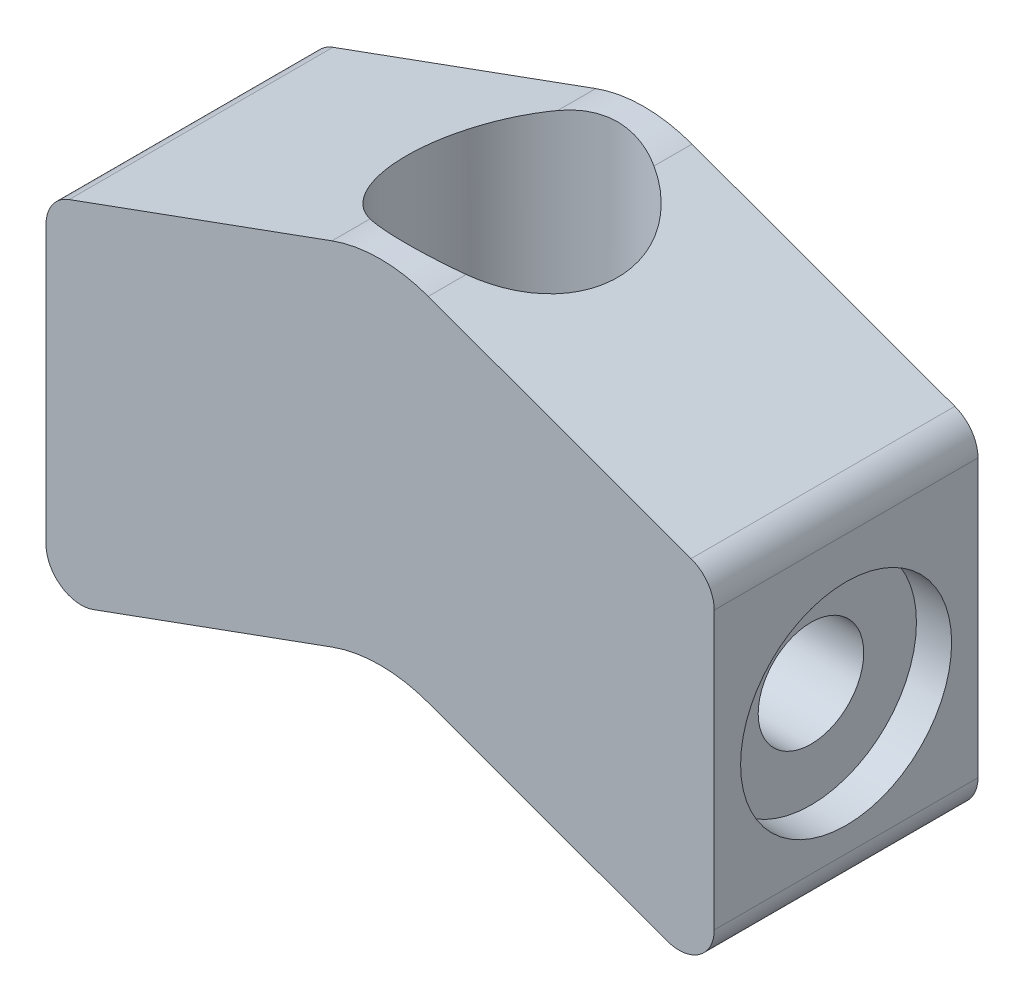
ISO-10303-21;
HEADER;
FILE_DESCRIPTION(('STEP AP214'),'2;1');
FILE_NAME('part.step','',(''),(''),'','','');
FILE_SCHEMA(('AUTOMOTIVE_DESIGN { 1 0 10303 214 1 1 1 1 }'));
ENDSEC;
DATA;
#1=APPLICATION_CONTEXT('core data for automotive mechanical design processes');
#2=APPLICATION_PROTOCOL_DEFINITION('international standard','automotive_design',2000,#1);
#3=PRODUCT_CONTEXT('',#1,'mechanical');
#4=PRODUCT('Part','Part','',(#3));
#5=PRODUCT_RELATED_PRODUCT_CATEGORY('part','',(#4));
#6=PRODUCT_DEFINITION_FORMATION('','',#4);
#7=PRODUCT_DEFINITION_CONTEXT('part definition',#1,'design');
#8=PRODUCT_DEFINITION('design','',#6,#7);
#9=PRODUCT_DEFINITION_SHAPE('','',#8);
#10=(LENGTH_UNIT() NAMED_UNIT(*) SI_UNIT(.MILLI.,.METRE.));
#11=(NAMED_UNIT(*) PLANE_ANGLE_UNIT() SI_UNIT($,.RADIAN.));
#12=(NAMED_UNIT(*) SI_UNIT($,.STERADIAN.) SOLID_ANGLE_UNIT());
#13=UNCERTAINTY_MEASURE_WITH_UNIT(LENGTH_MEASURE(1.E-05),#10,'distance_accuracy_value','');
#14=(GEOMETRIC_REPRESENTATION_CONTEXT(3) GLOBAL_UNCERTAINTY_ASSIGNED_CONTEXT((#13)) GLOBAL_UNIT_ASSIGNED_CONTEXT((#10,
#11,#12)) REPRESENTATION_CONTEXT('',''));
#15=CARTESIAN_POINT('',(0.,0.,0.));
#16=DIRECTION('',(0.,0.,1.));
#17=DIRECTION('',(1.,0.,0.));
#18=AXIS2_PLACEMENT_3D('',#15,#16,#17);
#19=CARTESIAN_POINT('',(19.,-18.4406551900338,0.));
#20=DIRECTION('',(-1.,0.,0.));
#21=DIRECTION('',(0.,-1.,0.));
#22=AXIS2_PLACEMENT_3D('',#19,#20,#21);
#23=CYLINDRICAL_SURFACE('',#22,3.);
#24=CARTESIAN_POINT('',(6.,-21.4406551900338,0.));
#25=CARTESIAN_POINT('',(5.99999934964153,-21.4406543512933,-0.07889414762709));
#26=CARTESIAN_POINT('',(5.99843869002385,-21.4375372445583,-0.15779662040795));
#27=CARTESIAN_POINT('',(5.99224358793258,-21.4251159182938,-0.315001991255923));
#28=CARTESIAN_POINT('',(5.98760776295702,-21.4158089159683,-0.393304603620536));
#29=CARTESIAN_POINT('',(5.96921978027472,-21.3786973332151,-0.626628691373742));
#30=CARTESIAN_POINT('',(5.95098734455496,-21.3417023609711,-0.779952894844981));
#31=CARTESIAN_POINT('',(5.90448966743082,-21.2450734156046,-1.07683586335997));
#32=CARTESIAN_POINT('',(5.87626344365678,-21.1855274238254,-1.22043005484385));
#33=CARTESIAN_POINT('',(5.81237302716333,-21.0459439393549,-1.49540820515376));
#34=CARTESIAN_POINT('',(5.77670942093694,-20.9659080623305,-1.62679312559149));
#35=CARTESIAN_POINT('',(5.69868752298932,-20.7821012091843,-1.88252701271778));
#36=CARTESIAN_POINT('',(5.65605474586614,-20.6771872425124,-2.0059694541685));
#37=CARTESIAN_POINT('',(5.56980033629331,-20.4490992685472,-2.23433451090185));
#38=CARTESIAN_POINT('',(5.5261779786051,-20.3259114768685,-2.33924301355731));
#39=CARTESIAN_POINT('',(5.43896347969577,-20.053170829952,-2.53576864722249));
#40=CARTESIAN_POINT('',(5.39563602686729,-19.9023142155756,-2.62572411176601));
#41=CARTESIAN_POINT('',(5.33782449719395,-19.6647043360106,-2.7403403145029));
#42=CARTESIAN_POINT('',(5.31974570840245,-19.583584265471,-2.77516786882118));
#43=CARTESIAN_POINT('',(5.28665768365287,-19.4180546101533,-2.83769299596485));
#44=CARTESIAN_POINT('',(5.27164663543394,-19.3336470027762,-2.86539478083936));
#45=CARTESIAN_POINT('',(5.24610341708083,-19.1672593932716,-2.91188280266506));
#46=CARTESIAN_POINT('',(5.23535838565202,-19.0854323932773,-2.93110042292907));
#47=CARTESIAN_POINT('',(5.21757784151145,-18.9201002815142,-2.9626355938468));
#48=CARTESIAN_POINT('',(5.21054036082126,-18.8365960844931,-2.97495680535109));
#49=CARTESIAN_POINT('',(5.20047756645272,-18.6686488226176,-2.99251382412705));
#50=CARTESIAN_POINT('',(5.19744983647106,-18.5842063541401,-2.99775389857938));
#51=CARTESIAN_POINT('',(5.19552555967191,-18.4151615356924,-3.00108452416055));
#52=CARTESIAN_POINT('',(5.19662861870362,-18.3305592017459,-2.9991757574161));
#53=CARTESIAN_POINT('',(5.20534668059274,-18.0979012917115,-2.98404973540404));
#54=CARTESIAN_POINT('',(5.21726794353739,-17.9504110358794,-2.96335042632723));
#55=CARTESIAN_POINT('',(5.25228182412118,-17.6614615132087,-2.90082280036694));
#56=CARTESIAN_POINT('',(5.2753780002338,-17.5200041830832,-2.85898775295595));
#57=CARTESIAN_POINT('',(5.33062568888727,-17.242975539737,-2.75462843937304));
#58=CARTESIAN_POINT('',(5.36297559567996,-17.1076180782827,-2.69164495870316));
#59=CARTESIAN_POINT('',(5.43310175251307,-16.8487502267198,-2.54712530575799));
#60=CARTESIAN_POINT('',(5.47088043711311,-16.7252451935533,-2.46558080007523));
#61=CARTESIAN_POINT('',(5.55339485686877,-16.477092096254,-2.27419808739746));
#62=CARTESIAN_POINT('',(5.59840533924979,-16.3542847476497,-2.16208335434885));
#63=CARTESIAN_POINT('',(5.6864286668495,-16.1284487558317,-1.91866675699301));
#64=CARTESIAN_POINT('',(5.72944054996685,-16.0254295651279,-1.78735577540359));
#65=CARTESIAN_POINT('',(5.81105962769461,-15.8375982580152,-1.50154951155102));
#66=CARTESIAN_POINT('',(5.84936952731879,-15.7538537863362,-1.3462607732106));
#67=CARTESIAN_POINT('',(5.91473643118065,-15.614364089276,-1.02139864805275));
#68=CARTESIAN_POINT('',(5.94180236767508,-15.5585966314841,-0.851836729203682));
#69=CARTESIAN_POINT('',(5.97973001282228,-15.4812289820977,-0.518299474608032));
#70=CARTESIAN_POINT('',(5.99174814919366,-15.4571814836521,-0.355024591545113));
#71=CARTESIAN_POINT('',(6.00219040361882,-15.4362609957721,-0.0263387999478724));
#72=CARTESIAN_POINT('',(6.00062096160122,-15.4393751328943,0.139071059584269));
#73=CARTESIAN_POINT('',(5.98473576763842,-15.471275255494,0.453698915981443));
#74=CARTESIAN_POINT('',(5.97141737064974,-15.4980527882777,0.603178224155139));
#75=CARTESIAN_POINT('',(5.93466513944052,-15.5733694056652,0.895220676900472));
#76=CARTESIAN_POINT('',(5.91123019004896,-15.6219108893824,1.03778305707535));
#77=CARTESIAN_POINT('',(5.85552754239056,-15.7406505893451,1.31666582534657));
#78=CARTESIAN_POINT('',(5.82302645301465,-15.8114283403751,1.45269119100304));
#79=CARTESIAN_POINT('',(5.75231922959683,-15.9719777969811,1.71138408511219));
#80=CARTESIAN_POINT('',(5.71411066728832,-16.0617575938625,1.83404588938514));
#81=CARTESIAN_POINT('',(5.63124663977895,-16.2679364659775,2.07530306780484));
#82=CARTESIAN_POINT('',(5.58632654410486,-16.3860837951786,2.19231623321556));
#83=CARTESIAN_POINT('',(5.49787174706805,-16.6404306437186,2.40556896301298));
#84=CARTESIAN_POINT('',(5.4543380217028,-16.7766425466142,2.50179415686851));
#85=CARTESIAN_POINT('',(5.3715357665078,-17.0715861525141,2.675123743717));
#86=CARTESIAN_POINT('',(5.33257588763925,-17.2310889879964,2.75107648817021));
#87=CARTESIAN_POINT('',(5.26722216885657,-17.5631853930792,2.87424847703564));
#88=CARTESIAN_POINT('',(5.24081214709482,-17.735761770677,2.92150474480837));
#89=CARTESIAN_POINT('',(5.2068450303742,-18.0713858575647,2.98158506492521));
#90=CARTESIAN_POINT('',(5.19772150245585,-18.2337579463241,2.997278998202));
#91=CARTESIAN_POINT('',(5.19496064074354,-18.5589963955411,3.00206745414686));
#92=CARTESIAN_POINT('',(5.20131659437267,-18.7218625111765,2.99117350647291));
#93=CARTESIAN_POINT('',(5.22713585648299,-19.0271056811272,2.94577840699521));
#94=CARTESIAN_POINT('',(5.24529281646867,-19.1699565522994,2.91362505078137));
#95=CARTESIAN_POINT('',(5.29113050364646,-19.448079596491,2.82952596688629));
#96=CARTESIAN_POINT('',(5.3188142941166,-19.5833493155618,2.77757387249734));
#97=CARTESIAN_POINT('',(5.38285583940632,-19.8525295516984,2.65144766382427));
#98=CARTESIAN_POINT('',(5.41967139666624,-19.9857381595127,2.57601505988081));
#99=CARTESIAN_POINT('',(5.49706022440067,-20.2384795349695,2.40645126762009));
#100=CARTESIAN_POINT('',(5.53763544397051,-20.3580051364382,2.31231035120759));
#101=CARTESIAN_POINT('',(5.62386853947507,-20.5950780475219,2.094616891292));
#102=CARTESIAN_POINT('',(5.66954494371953,-20.7106203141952,1.96888052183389));
#103=CARTESIAN_POINT('',(5.75633712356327,-20.9194563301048,1.69843715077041));
#104=CARTESIAN_POINT('',(5.79745043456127,-21.012738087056,1.55371998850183));
#105=CARTESIAN_POINT('',(5.85251406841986,-21.1338333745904,1.32452333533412));
#106=CARTESIAN_POINT('',(5.86982524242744,-21.1711753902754,1.24575314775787));
#107=CARTESIAN_POINT('',(5.90168845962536,-21.2390168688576,1.08479725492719));
#108=CARTESIAN_POINT('',(5.91624185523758,-21.2695196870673,1.00261324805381));
#109=CARTESIAN_POINT('',(5.94212690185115,-21.3232624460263,0.835616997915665));
#110=CARTESIAN_POINT('',(5.95346557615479,-21.3465182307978,0.750810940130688));
#111=CARTESIAN_POINT('',(5.97260771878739,-21.3855377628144,0.579142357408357));
#112=CARTESIAN_POINT('',(5.98041334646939,-21.4013060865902,0.492281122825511));
#113=CARTESIAN_POINT('',(5.99085829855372,-21.4223398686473,0.337824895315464));
#114=CARTESIAN_POINT('',(5.99428035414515,-21.4292021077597,0.270495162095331));
#115=CARTESIAN_POINT('',(5.99885151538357,-21.4383601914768,0.135445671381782));
#116=CARTESIAN_POINT('',(6.00000055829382,-21.4406559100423,0.0677259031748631));
#117=CARTESIAN_POINT('',(6.,-21.4406551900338,0.));
#118=B_SPLINE_CURVE_WITH_KNOTS('',3,(#24,#25,#26,#27,#28,#29,#30,#31,#32,#33,#34,#35,#36,#37,
#38,#39,#40,#41,#42,#43,#44,#45,#46,#47,#48,#49,#50,#51,#52,#53,#54,#55,#56,#57,#58,#59,#60,#61,
#62,#63,#64,#65,#66,#67,#68,#69,#70,#71,#72,#73,#74,#75,#76,#77,#78,#79,#80,#81,#82,#83,#84,#85,
#86,#87,#88,#89,#90,#91,#92,#93,#94,#95,#96,#97,#98,#99,#100,#101,#102,#103,#104,#105,#106,#107,
#108,#109,#110,#111,#112,#113,#114,#115,#116,#117),.UNSPECIFIED.,.T.,.F.,(4,2,2,2,2,2,2,2,2,2,2,
2,2,2,2,2,2,2,2,2,2,2,2,2,2,2,2,2,2,2,2,2,2,2,2,2,2,2,2,2,2,2,2,2,2,2,4),(0.,0.236611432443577,
0.473329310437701,0.947100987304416,1.41904300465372,1.89094781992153,2.39140181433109,
2.89223525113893,3.4319083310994,3.70192714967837,3.97178599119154,4.2256372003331,
4.47935352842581,4.73291689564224,4.98645606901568,5.43238672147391,5.87845946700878,
6.33492255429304,6.79159098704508,7.30616358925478,7.82098138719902,8.35970601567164,
8.89800185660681,9.3917140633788,9.88519228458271,10.3404225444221,10.7957029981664,
11.2640010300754,11.7324988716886,12.2470036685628,12.7618630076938,13.3016558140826,
13.8407507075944,14.3280945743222,14.8152271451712,15.2559532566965,15.6968212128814,
16.1673090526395,16.6380421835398,17.1659726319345,17.6941868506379,17.9605054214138,
18.2266930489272,18.4922945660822,18.7577335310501,18.9608446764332,19.1639614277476),.UNSPECIFIED.);
#119=CARTESIAN_POINT('',(6.,-21.4406551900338,0.));
#120=VERTEX_POINT('',#119);
#121=EDGE_CURVE('E216',#120,#120,#118,.T.);
#122=ORIENTED_EDGE('',*,*,#121,.F.);
#123=EDGE_LOOP('',(#122));
#124=FACE_BOUND('',#123,.T.);
#125=CARTESIAN_POINT('',(17.,-18.4406551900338,0.));
#126=DIRECTION('',(1.,0.,0.));
#127=DIRECTION('',(0.,1.,0.));
#128=AXIS2_PLACEMENT_3D('',#125,#126,#127);
#129=CIRCLE('',#128,3.);
#130=CARTESIAN_POINT('',(17.,-15.4406551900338,0.));
#131=VERTEX_POINT('',#130);
#132=EDGE_CURVE('E39',#131,#131,#129,.F.);
#133=ORIENTED_EDGE('',*,*,#132,.F.);
#134=EDGE_LOOP('',(#133));
#135=FACE_BOUND('',#134,.T.);
#136=ADVANCED_FACE('F34',(#124,#135),#23,.F.);
#137=CARTESIAN_POINT('',(0.,-30.2933906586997,7.5));
#138=DIRECTION('',(0.,0.,-1.));
#139=DIRECTION('',(-1.,0.,0.));
#140=AXIS2_PLACEMENT_3D('',#137,#138,#139);
#141=CYLINDRICAL_SURFACE('',#140,8.);
#142=DIRECTION('',(0.,0.,-1.));
#143=VECTOR('',#142,1.);
#144=CARTESIAN_POINT('',(2.73616114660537,-22.7758496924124,7.5));
#145=LINE('',#144,#143);
#146=CARTESIAN_POINT('',(2.73616114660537,-22.7758496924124,-5.33979608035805));
#147=VERTEX_POINT('',#146);
#148=CARTESIAN_POINT('',(2.73616114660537,-22.7758496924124,-7.5));
#149=VERTEX_POINT('',#148);
#150=EDGE_CURVE('E160',#147,#149,#145,.T.);
#151=ORIENTED_EDGE('',*,*,#150,.F.);
#152=CARTESIAN_POINT('',(2.73616114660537,-22.7758496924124,-5.33979608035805));
#153=CARTESIAN_POINT('',(2.61439146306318,-22.731513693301,-5.40220379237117));
#154=CARTESIAN_POINT('',(2.48976445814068,-22.6895192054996,-5.4607925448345));
#155=CARTESIAN_POINT('',(2.23526143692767,-22.6108586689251,-5.56980717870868));
#156=CARTESIAN_POINT('',(2.10538184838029,-22.5741963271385,-5.62022738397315));
#157=CARTESIAN_POINT('',(1.84067817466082,-22.5068244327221,-5.71240736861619));
#158=CARTESIAN_POINT('',(1.70584251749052,-22.4761300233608,-5.75414513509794));
#159=CARTESIAN_POINT('',(1.43232062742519,-22.4214214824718,-5.82825237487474));
#160=CARTESIAN_POINT('',(1.29363528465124,-22.3974058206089,-5.86062399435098));
#161=CARTESIAN_POINT('',(1.01266172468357,-22.3564669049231,-5.91566550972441));
#162=CARTESIAN_POINT('',(0.870360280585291,-22.3395755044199,-5.93829184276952));
#163=CARTESIAN_POINT('',(0.583806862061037,-22.3134241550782,-5.97327387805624));
#164=CARTESIAN_POINT('',(0.439554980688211,-22.3041638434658,-5.98563006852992));
#165=CARTESIAN_POINT('',(0.150510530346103,-22.2935017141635,-5.99985376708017));
#166=CARTESIAN_POINT('',(0.0057194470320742,-22.2920854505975,-6.00174055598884));
#167=CARTESIAN_POINT('',(-0.283473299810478,-22.2971068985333,-5.99504454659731));
#168=CARTESIAN_POINT('',(-0.42787499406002,-22.3035439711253,-5.98646259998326));
#169=CARTESIAN_POINT('',(-0.706618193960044,-22.323506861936,-5.95979194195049));
#170=CARTESIAN_POINT('',(-0.841049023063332,-22.3365902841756,-5.94229635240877));
#171=CARTESIAN_POINT('',(-1.10769437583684,-22.3693094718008,-5.8984130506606));
#172=CARTESIAN_POINT('',(-1.23990799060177,-22.3889478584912,-5.87202178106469));
#173=CARTESIAN_POINT('',(-1.50128029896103,-22.434398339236,-5.81069565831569));
#174=CARTESIAN_POINT('',(-1.63043823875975,-22.4602119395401,-5.77575872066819));
#175=CARTESIAN_POINT('',(-1.88498589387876,-22.5175401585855,-5.69776703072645));
#176=CARTESIAN_POINT('',(-2.0103753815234,-22.5490551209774,-5.65471178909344));
#177=CARTESIAN_POINT('',(-2.2374379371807,-22.6118879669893,-5.56832299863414));
#178=CARTESIAN_POINT('',(-2.33974278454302,-22.6424593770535,-5.52609526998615));
#179=CARTESIAN_POINT('',(-2.54067461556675,-22.7068180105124,-5.43663824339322));
#180=CARTESIAN_POINT('',(-2.63931243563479,-22.7405945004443,-5.38942558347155));
#181=CARTESIAN_POINT('',(-2.73616114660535,-22.7758496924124,-5.33979608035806));
#182=B_SPLINE_CURVE_WITH_KNOTS('',3,(#152,#153,#154,#155,#156,#157,#158,#159,#160,#161,#162,
#163,#164,#165,#166,#167,#168,#169,#170,#171,#172,#173,#174,#175,#176,#177,#178,#179,#180,#181),
.UNSPECIFIED.,.F.,.F.,(4,2,2,2,2,2,2,2,2,2,2,2,2,2,4),(0.,0.431465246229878,0.863229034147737,
1.29607449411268,1.72882069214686,2.16348174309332,2.59812212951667,3.03196180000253,
3.46576617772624,3.87387924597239,4.28215571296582,4.69053186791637,5.09893264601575,
5.44318913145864,5.78633090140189),.UNSPECIFIED.);
#183=CARTESIAN_POINT('',(-2.73616114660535,-22.7758496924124,-5.33979608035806));
#184=VERTEX_POINT('',#183);
#185=EDGE_CURVE('E148',#147,#184,#182,.T.);
#186=ORIENTED_EDGE('',*,*,#185,.T.);
#187=DIRECTION('',(0.,0.,-1.));
#188=VECTOR('',#187,1.);
#189=CARTESIAN_POINT('',(-2.73616114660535,-22.7758496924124,7.5));
#190=LINE('',#189,#188);
#191=CARTESIAN_POINT('',(-2.73616114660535,-22.7758496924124,-7.5));
#192=VERTEX_POINT('',#191);
#193=EDGE_CURVE('E158',#184,#192,#190,.T.);
#194=ORIENTED_EDGE('',*,*,#193,.T.);
#195=CARTESIAN_POINT('',(0.,-30.2933906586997,-7.5));
#196=DIRECTION('',(0.,0.,-1.));
#197=DIRECTION('',(-1.,0.,0.));
#198=AXIS2_PLACEMENT_3D('',#195,#196,#197);
#199=CIRCLE('',#198,8.);
#200=EDGE_CURVE('E355',#192,#149,#199,.T.);
#201=ORIENTED_EDGE('',*,*,#200,.T.);
#202=EDGE_LOOP('',(#151,#186,#194,#201));
#203=FACE_BOUND('',#202,.T.);
#204=ADVANCED_FACE('F156',(#203),#141,.F.);
#205=CARTESIAN_POINT('',(0.,-10.2868485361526,7.5));
#206=DIRECTION('',(0.,0.,-1.));
#207=DIRECTION('',(-1.,0.,0.));
#208=AXIS2_PLACEMENT_3D('',#205,#206,#207);
#209=CYLINDRICAL_SURFACE('',#208,8.);
#210=DIRECTION('',(0.,0.,-1.));
#211=VECTOR('',#210,1.);
#212=CARTESIAN_POINT('',(2.73616114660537,-2.7693075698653,7.5));
#213=LINE('',#212,#211);
#214=CARTESIAN_POINT('',(2.73616114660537,-2.7693075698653,7.5));
#215=VERTEX_POINT('',#214);
#216=CARTESIAN_POINT('',(2.73616114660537,-2.7693075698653,5.33979608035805));
#217=VERTEX_POINT('',#216);
#218=EDGE_CURVE('E192',#215,#217,#213,.T.);
#219=ORIENTED_EDGE('',*,*,#218,.T.);
#220=CARTESIAN_POINT('',(2.73616114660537,-2.7693075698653,5.33979608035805));
#221=CARTESIAN_POINT('',(2.61439146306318,-2.72497157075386,5.40220379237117));
#222=CARTESIAN_POINT('',(2.48976445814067,-2.6829770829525,5.4607925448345));
#223=CARTESIAN_POINT('',(2.23526143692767,-2.60431654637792,5.56980717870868));
#224=CARTESIAN_POINT('',(2.10538184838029,-2.56765420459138,5.62022738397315));
#225=CARTESIAN_POINT('',(1.84067817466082,-2.50028231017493,5.71240736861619));
#226=CARTESIAN_POINT('',(1.70584251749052,-2.46958790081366,5.75414513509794));
#227=CARTESIAN_POINT('',(1.43232062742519,-2.41487935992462,5.82825237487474));
#228=CARTESIAN_POINT('',(1.29363528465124,-2.3908636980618,5.86062399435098));
#229=CARTESIAN_POINT('',(1.01266172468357,-2.34992478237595,5.91566550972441));
#230=CARTESIAN_POINT('',(0.87036028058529,-2.33303338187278,5.93829184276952));
#231=CARTESIAN_POINT('',(0.583806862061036,-2.3068820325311,5.97327387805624));
#232=CARTESIAN_POINT('',(0.43955498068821,-2.29762172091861,5.98563006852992));
#233=CARTESIAN_POINT('',(0.150510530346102,-2.2869595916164,5.99985376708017));
#234=CARTESIAN_POINT('',(0.0057194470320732,-2.28554332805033,6.00174055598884));
#235=CARTESIAN_POINT('',(-0.283473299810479,-2.29056477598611,5.99504454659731));
#236=CARTESIAN_POINT('',(-0.427874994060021,-2.29700184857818,5.98646259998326));
#237=CARTESIAN_POINT('',(-0.706618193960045,-2.31696473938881,5.95979194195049));
#238=CARTESIAN_POINT('',(-0.841049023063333,-2.33004816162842,5.94229635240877));
#239=CARTESIAN_POINT('',(-1.10769437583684,-2.36276734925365,5.8984130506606));
#240=CARTESIAN_POINT('',(-1.23990799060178,-2.38240573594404,5.87202178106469));
#241=CARTESIAN_POINT('',(-1.50128029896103,-2.4278562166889,5.81069565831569));
#242=CARTESIAN_POINT('',(-1.63043823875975,-2.45366981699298,5.77575872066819));
#243=CARTESIAN_POINT('',(-1.88498589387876,-2.51099803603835,5.69776703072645));
#244=CARTESIAN_POINT('',(-2.0103753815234,-2.54251299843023,5.65471178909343));
#245=CARTESIAN_POINT('',(-2.2374379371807,-2.60534584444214,5.56832299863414));
#246=CARTESIAN_POINT('',(-2.33974278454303,-2.63591725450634,5.52609526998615));
#247=CARTESIAN_POINT('',(-2.54067461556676,-2.70027588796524,5.43663824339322));
#248=CARTESIAN_POINT('',(-2.63931243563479,-2.73405237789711,5.38942558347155));
#249=CARTESIAN_POINT('',(-2.73616114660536,-2.7693075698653,5.33979608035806));
#250=B_SPLINE_CURVE_WITH_KNOTS('',3,(#220,#221,#222,#223,#224,#225,#226,#227,#228,#229,#230,
#231,#232,#233,#234,#235,#236,#237,#238,#239,#240,#241,#242,#243,#244,#245,#246,#247,#248,#249),
.UNSPECIFIED.,.F.,.F.,(4,2,2,2,2,2,2,2,2,2,2,2,2,2,4),(0.,0.431465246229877,0.863229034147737,
1.29607449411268,1.72882069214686,2.16348174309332,2.59812212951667,3.03196180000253,
3.46576617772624,3.87387924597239,4.28215571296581,4.69053186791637,5.09893264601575,
5.44318913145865,5.7863309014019),.UNSPECIFIED.);
#251=CARTESIAN_POINT('',(-2.73616114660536,-2.7693075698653,5.33979608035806));
#252=VERTEX_POINT('',#251);
#253=EDGE_CURVE('E275',#217,#252,#250,.T.);
#254=ORIENTED_EDGE('',*,*,#253,.T.);
#255=DIRECTION('',(0.,0.,-1.));
#256=VECTOR('',#255,1.);
#257=CARTESIAN_POINT('',(-2.73616114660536,-2.7693075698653,7.5));
#258=LINE('',#257,#256);
#259=CARTESIAN_POINT('',(-2.73616114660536,-2.7693075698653,7.5));
#260=VERTEX_POINT('',#259);
#261=EDGE_CURVE('E188',#260,#252,#258,.T.);
#262=ORIENTED_EDGE('',*,*,#261,.F.);
#263=CARTESIAN_POINT('',(0.,-10.2868485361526,7.5));
#264=DIRECTION('',(0.,0.,1.));
#265=DIRECTION('',(-1.,0.,0.));
#266=AXIS2_PLACEMENT_3D('',#263,#264,#265);
#267=CIRCLE('',#266,8.);
#268=EDGE_CURVE('E363',#215,#260,#267,.T.);
#269=ORIENTED_EDGE('',*,*,#268,.F.);
#270=EDGE_LOOP('',(#219,#254,#262,#269));
#271=FACE_BOUND('',#270,.T.);
#272=ADVANCED_FACE('F289',(#271),#209,.T.);
#273=CARTESIAN_POINT('',(-2.73616114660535,-22.7758496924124,7.5));
#274=VERTEX_POINT('',#273);
#275=CARTESIAN_POINT('',(-2.73616114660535,-22.7758496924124,5.33979608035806));
#276=VERTEX_POINT('',#275);
#277=EDGE_CURVE('E168',#274,#276,#190,.T.);
#278=ORIENTED_EDGE('',*,*,#277,.T.);
#279=CARTESIAN_POINT('',(-2.73616114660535,-22.7758496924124,5.33979608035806));
#280=CARTESIAN_POINT('',(-2.61439146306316,-22.731513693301,5.40220379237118));
#281=CARTESIAN_POINT('',(-2.48976445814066,-22.6895192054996,5.4607925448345));
#282=CARTESIAN_POINT('',(-2.23526143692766,-22.6108586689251,5.56980717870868));
#283=CARTESIAN_POINT('',(-2.10538184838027,-22.5741963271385,5.62022738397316));
#284=CARTESIAN_POINT('',(-1.84067817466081,-22.5068244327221,5.71240736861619));
#285=CARTESIAN_POINT('',(-1.7058425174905,-22.4761300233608,5.75414513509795));
#286=CARTESIAN_POINT('',(-1.43232062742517,-22.4214214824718,5.82825237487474));
#287=CARTESIAN_POINT('',(-1.29363528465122,-22.3974058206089,5.86062399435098));
#288=CARTESIAN_POINT('',(-1.01266172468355,-22.3564669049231,5.91566550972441));
#289=CARTESIAN_POINT('',(-0.870360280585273,-22.3395755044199,5.93829184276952));
#290=CARTESIAN_POINT('',(-0.583806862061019,-22.3134241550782,5.97327387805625));
#291=CARTESIAN_POINT('',(-0.439554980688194,-22.3041638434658,5.98563006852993));
#292=CARTESIAN_POINT('',(-0.150510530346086,-22.2935017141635,5.99985376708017));
#293=CARTESIAN_POINT('',(-0.00571944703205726,-22.2920854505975,6.00174055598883));
#294=CARTESIAN_POINT('',(0.283473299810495,-22.2971068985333,5.99504454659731));
#295=CARTESIAN_POINT('',(0.427874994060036,-22.3035439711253,5.98646259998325));
#296=CARTESIAN_POINT('',(0.70661819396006,-22.323506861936,5.95979194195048));
#297=CARTESIAN_POINT('',(0.841049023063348,-22.3365902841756,5.94229635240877));
#298=CARTESIAN_POINT('',(1.10769437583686,-22.3693094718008,5.89841305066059));
#299=CARTESIAN_POINT('',(1.23990799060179,-22.3889478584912,5.87202178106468));
#300=CARTESIAN_POINT('',(1.50128029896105,-22.434398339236,5.81069565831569));
#301=CARTESIAN_POINT('',(1.63043823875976,-22.4602119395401,5.77575872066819));
#302=CARTESIAN_POINT('',(1.88498589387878,-22.5175401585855,5.69776703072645));
#303=CARTESIAN_POINT('',(2.01037538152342,-22.5490551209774,5.65471178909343));
#304=CARTESIAN_POINT('',(2.23743793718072,-22.6118879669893,5.56832299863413));
#305=CARTESIAN_POINT('',(2.33974278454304,-22.6424593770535,5.52609526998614));
#306=CARTESIAN_POINT('',(2.54067461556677,-22.7068180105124,5.43663824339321));
#307=CARTESIAN_POINT('',(2.6393124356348,-22.7405945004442,5.38942558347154));
#308=CARTESIAN_POINT('',(2.73616114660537,-22.7758496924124,5.33979608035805));
#309=B_SPLINE_CURVE_WITH_KNOTS('',3,(#279,#280,#281,#282,#283,#284,#285,#286,#287,#288,#289,
#290,#291,#292,#293,#294,#295,#296,#297,#298,#299,#300,#301,#302,#303,#304,#305,#306,#307,#308),
.UNSPECIFIED.,.F.,.F.,(4,2,2,2,2,2,2,2,2,2,2,2,2,2,4),(0.,0.431465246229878,0.863229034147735,
1.29607449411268,1.72882069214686,2.16348174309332,2.59812212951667,3.03196180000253,
3.46576617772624,3.87387924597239,4.28215571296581,4.69053186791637,5.09893264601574,
5.44318913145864,5.78633090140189),.UNSPECIFIED.);
#310=CARTESIAN_POINT('',(2.73616114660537,-22.7758496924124,5.33979608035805));
#311=VERTEX_POINT('',#310);
#312=EDGE_CURVE('E60',#276,#311,#309,.T.);
#313=ORIENTED_EDGE('',*,*,#312,.T.);
#314=CARTESIAN_POINT('',(2.73616114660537,-22.7758496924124,7.5));
#315=VERTEX_POINT('',#314);
#316=EDGE_CURVE('E44',#315,#311,#145,.T.);
#317=ORIENTED_EDGE('',*,*,#316,.F.);
#318=CARTESIAN_POINT('',(0.,-30.2933906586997,7.5));
#319=DIRECTION('',(0.,0.,-1.));
#320=DIRECTION('',(-1.,0.,0.));
#321=AXIS2_PLACEMENT_3D('',#318,#319,#320);
#322=CIRCLE('',#321,8.);
#323=EDGE_CURVE('E318',#274,#315,#322,.T.);
#324=ORIENTED_EDGE('',*,*,#323,.F.);
#325=EDGE_LOOP('',(#278,#313,#317,#324));
#326=FACE_BOUND('',#325,.T.);
#327=ADVANCED_FACE('F36',(#326),#141,.F.);
#328=CARTESIAN_POINT('',(16.3159597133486,-27.7184921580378,7.5));
#329=DIRECTION('',(0.342020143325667,0.939692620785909,0.));
#330=DIRECTION('',(-0.939692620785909,0.342020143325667,0.));
#331=AXIS2_PLACEMENT_3D('',#328,#329,#330);
#332=PLANE('',#331);
#333=ORIENTED_EDGE('',*,*,#316,.T.);
#334=CARTESIAN_POINT('',(0.,-21.7799684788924,0.));
#335=DIRECTION('',(0.342020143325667,0.939692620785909,0.));
#336=DIRECTION('',(-0.939692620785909,0.342020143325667,0.));
#337=AXIS2_PLACEMENT_3D('',#334,#335,#336);
#338=ELLIPSE('',#337,6.38506663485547,6.);
#339=EDGE_CURVE('E161',#311,#147,#338,.T.);
#340=ORIENTED_EDGE('',*,*,#339,.T.);
#341=ORIENTED_EDGE('',*,*,#150,.T.);
#342=DIRECTION('',(0.939692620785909,-0.342020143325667,0.));
#343=VECTOR('',#342,1.);
#344=CARTESIAN_POINT('',(16.3159597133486,-27.7184921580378,-7.5));
#345=LINE('',#344,#343);
#346=CARTESIAN_POINT('',(16.3159597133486,-27.7184921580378,-7.5));
#347=VERTEX_POINT('',#346);
#348=EDGE_CURVE('E353',#149,#347,#345,.T.);
#349=ORIENTED_EDGE('',*,*,#348,.T.);
#350=DIRECTION('',(0.,0.,-1.));
#351=VECTOR('',#350,1.);
#352=CARTESIAN_POINT('',(16.3159597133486,-27.7184921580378,7.5));
#353=LINE('',#352,#351);
#354=CARTESIAN_POINT('',(16.3159597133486,-27.7184921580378,7.5));
#355=VERTEX_POINT('',#354);
#356=EDGE_CURVE('E204',#355,#347,#353,.T.);
#357=ORIENTED_EDGE('',*,*,#356,.F.);
#358=DIRECTION('',(0.939692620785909,-0.342020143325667,0.));
#359=VECTOR('',#358,1.);
#360=CARTESIAN_POINT('',(16.3159597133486,-27.7184921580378,7.5));
#361=LINE('',#360,#359);
#362=EDGE_CURVE('E315',#315,#355,#361,.T.);
#363=ORIENTED_EDGE('',*,*,#362,.F.);
#364=EDGE_LOOP('',(#333,#340,#341,#349,#357,#363));
#365=FACE_BOUND('',#364,.T.);
#366=ADVANCED_FACE('F305',(#365),#332,.F.);
#367=CARTESIAN_POINT('',(17.,-25.839106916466,7.5));
#368=DIRECTION('',(0.,0.,-1.));
#369=DIRECTION('',(-1.,0.,0.));
#370=AXIS2_PLACEMENT_3D('',#367,#368,#369);
#371=CYLINDRICAL_SURFACE('',#370,2.);
#372=CARTESIAN_POINT('',(17.,-25.839106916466,-7.5));
#373=DIRECTION('',(0.,0.,1.));
#374=DIRECTION('',(1.,0.,0.));
#375=AXIS2_PLACEMENT_3D('',#372,#373,#374);
#376=CIRCLE('',#375,2.);
#377=CARTESIAN_POINT('',(19.,-25.839106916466,-7.5));
#378=VERTEX_POINT('',#377);
#379=EDGE_CURVE('E351',#347,#378,#376,.T.);
#380=ORIENTED_EDGE('',*,*,#379,.T.);
#381=DIRECTION('',(0.,0.,-1.));
#382=VECTOR('',#381,1.);
#383=CARTESIAN_POINT('',(19.,-25.839106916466,7.5));
#384=LINE('',#383,#382);
#385=CARTESIAN_POINT('',(19.,-25.839106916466,7.5));
#386=VERTEX_POINT('',#385);
#387=EDGE_CURVE('E201',#386,#378,#384,.T.);
#388=ORIENTED_EDGE('',*,*,#387,.F.);
#389=CARTESIAN_POINT('',(17.,-25.839106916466,7.5));
#390=DIRECTION('',(0.,0.,1.));
#391=DIRECTION('',(1.,0.,0.));
#392=AXIS2_PLACEMENT_3D('',#389,#390,#391);
#393=CIRCLE('',#392,2.);
#394=EDGE_CURVE('E371',#355,#386,#393,.T.);
#395=ORIENTED_EDGE('',*,*,#394,.F.);
#396=ORIENTED_EDGE('',*,*,#356,.T.);
#397=EDGE_LOOP('',(#380,#388,#395,#396));
#398=FACE_BOUND('',#397,.T.);
#399=ADVANCED_FACE('F302',(#398),#371,.T.);
#400=CARTESIAN_POINT('',(19.,-10.0892758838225,7.5));
#401=DIRECTION('',(-1.,0.,0.));
#402=DIRECTION('',(0.,-1.,0.));
#403=AXIS2_PLACEMENT_3D('',#400,#401,#402);
#404=PLANE('',#403);
#405=CARTESIAN_POINT('',(19.,-18.4406551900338,0.));
#406=DIRECTION('',(-1.,0.,0.));
#407=DIRECTION('',(0.,-1.,0.));
#408=AXIS2_PLACEMENT_3D('',#405,#406,#407);
#409=CIRCLE('',#408,6.);
#410=CARTESIAN_POINT('',(19.,-24.4406551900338,0.));
#411=VERTEX_POINT('',#410);
#412=EDGE_CURVE('E483',#411,#411,#409,.T.);
#413=ORIENTED_EDGE('',*,*,#412,.T.);
#414=EDGE_LOOP('',(#413));
#415=FACE_BOUND('',#414,.T.);
#416=DIRECTION('',(0.,1.,0.));
#417=VECTOR('',#416,1.);
#418=CARTESIAN_POINT('',(19.,-10.0892758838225,-7.5));
#419=LINE('',#418,#417);
#420=CARTESIAN_POINT('',(19.,-10.0892758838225,-7.5));
#421=VERTEX_POINT('',#420);
#422=EDGE_CURVE('E349',#378,#421,#419,.T.);
#423=ORIENTED_EDGE('',*,*,#422,.T.);
#424=DIRECTION('',(0.,0.,-1.));
#425=VECTOR('',#424,1.);
#426=CARTESIAN_POINT('',(19.,-10.0892758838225,7.5));
#427=LINE('',#426,#425);
#428=CARTESIAN_POINT('',(19.,-10.0892758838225,7.5));
#429=VERTEX_POINT('',#428);
#430=EDGE_CURVE('E198',#429,#421,#427,.T.);
#431=ORIENTED_EDGE('',*,*,#430,.F.);
#432=DIRECTION('',(0.,1.,0.));
#433=VECTOR('',#432,1.);
#434=CARTESIAN_POINT('',(19.,-10.0892758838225,7.5));
#435=LINE('',#434,#433);
#436=EDGE_CURVE('E369',#386,#429,#435,.T.);
#437=ORIENTED_EDGE('',*,*,#436,.F.);
#438=ORIENTED_EDGE('',*,*,#387,.T.);
#439=EDGE_LOOP('',(#423,#431,#437,#438));
#440=FACE_BOUND('',#439,.T.);
#441=ADVANCED_FACE('F298',(#415,#440),#404,.F.);
#442=CARTESIAN_POINT('',(17.,-10.0892758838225,7.5));
#443=DIRECTION('',(0.,0.,-1.));
#444=DIRECTION('',(-1.,0.,0.));
#445=AXIS2_PLACEMENT_3D('',#442,#443,#444);
#446=CYLINDRICAL_SURFACE('',#445,2.);
#447=CARTESIAN_POINT('',(17.,-10.0892758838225,-7.5));
#448=DIRECTION('',(0.,0.,1.));
#449=DIRECTION('',(1.,0.,0.));
#450=AXIS2_PLACEMENT_3D('',#447,#448,#449);
#451=CIRCLE('',#450,2.);
#452=CARTESIAN_POINT('',(17.6840402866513,-8.20989064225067,-7.5));
#453=VERTEX_POINT('',#452);
#454=EDGE_CURVE('E347',#421,#453,#451,.T.);
#455=ORIENTED_EDGE('',*,*,#454,.T.);
#456=DIRECTION('',(0.,0.,-1.));
#457=VECTOR('',#456,1.);
#458=CARTESIAN_POINT('',(17.6840402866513,-8.20989064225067,7.5));
#459=LINE('',#458,#457);
#460=CARTESIAN_POINT('',(17.6840402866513,-8.20989064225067,7.5));
#461=VERTEX_POINT('',#460);
#462=EDGE_CURVE('E195',#461,#453,#459,.T.);
#463=ORIENTED_EDGE('',*,*,#462,.F.);
#464=CARTESIAN_POINT('',(17.,-10.0892758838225,7.5));
#465=DIRECTION('',(0.,0.,1.));
#466=DIRECTION('',(1.,0.,0.));
#467=AXIS2_PLACEMENT_3D('',#464,#465,#466);
#468=CIRCLE('',#467,2.);
#469=EDGE_CURVE('E367',#429,#461,#468,.T.);
#470=ORIENTED_EDGE('',*,*,#469,.F.);
#471=ORIENTED_EDGE('',*,*,#430,.T.);
#472=EDGE_LOOP('',(#455,#463,#470,#471));
#473=FACE_BOUND('',#472,.T.);
#474=ADVANCED_FACE('F294',(#473),#446,.T.);
#475=CARTESIAN_POINT('',(2.73616114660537,-2.76930756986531,7.5));
#476=DIRECTION('',(-0.342020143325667,-0.939692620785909,0.));
#477=DIRECTION('',(0.939692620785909,-0.342020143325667,0.));
#478=AXIS2_PLACEMENT_3D('',#475,#476,#477);
#479=PLANE('',#478);
#480=CARTESIAN_POINT('',(2.73616114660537,-2.7693075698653,-5.33979608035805));
#481=VERTEX_POINT('',#480);
#482=CARTESIAN_POINT('',(2.73616114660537,-2.7693075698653,-7.5));
#483=VERTEX_POINT('',#482);
#484=EDGE_CURVE('E191',#481,#483,#213,.T.);
#485=ORIENTED_EDGE('',*,*,#484,.F.);
#486=CARTESIAN_POINT('',(0.,-1.77342635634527,0.));
#487=DIRECTION('',(-0.342020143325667,-0.939692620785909,0.));
#488=DIRECTION('',(-0.939692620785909,0.342020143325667,0.));
#489=AXIS2_PLACEMENT_3D('',#486,#487,#488);
#490=ELLIPSE('',#489,6.38506663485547,6.);
#491=EDGE_CURVE('E356',#481,#217,#490,.T.);
#492=ORIENTED_EDGE('',*,*,#491,.T.);
#493=ORIENTED_EDGE('',*,*,#218,.F.);
#494=DIRECTION('',(-0.939692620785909,0.342020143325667,0.));
#495=VECTOR('',#494,1.);
#496=CARTESIAN_POINT('',(2.73616114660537,-2.76930756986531,7.5));
#497=LINE('',#496,#495);
#498=EDGE_CURVE('E365',#461,#215,#497,.T.);
#499=ORIENTED_EDGE('',*,*,#498,.F.);
#500=ORIENTED_EDGE('',*,*,#462,.T.);
#501=DIRECTION('',(-0.939692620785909,0.342020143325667,0.));
#502=VECTOR('',#501,1.);
#503=CARTESIAN_POINT('',(2.73616114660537,-2.76930756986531,-7.5));
#504=LINE('',#503,#502);
#505=EDGE_CURVE('E344',#453,#483,#504,.T.);
#506=ORIENTED_EDGE('',*,*,#505,.T.);
#507=EDGE_LOOP('',(#485,#492,#493,#499,#500,#506));
#508=FACE_BOUND('',#507,.T.);
#509=ADVANCED_FACE('F287',(#508),#479,.F.);
#510=CARTESIAN_POINT('',(-2.73616114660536,-2.7693075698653,-5.33979608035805));
#511=VERTEX_POINT('',#510);
#512=CARTESIAN_POINT('',(-2.73616114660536,-2.7693075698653,-7.5));
#513=VERTEX_POINT('',#512);
#514=EDGE_CURVE('E187',#511,#513,#258,.T.);
#515=ORIENTED_EDGE('',*,*,#514,.F.);
#516=CARTESIAN_POINT('',(-2.73616114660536,-2.76930756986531,-5.33979608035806));
#517=CARTESIAN_POINT('',(-2.61439146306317,-2.72497157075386,-5.40220379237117));
#518=CARTESIAN_POINT('',(-2.48976445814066,-2.68297708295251,-5.4607925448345));
#519=CARTESIAN_POINT('',(-2.23526143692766,-2.60431654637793,-5.56980717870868));
#520=CARTESIAN_POINT('',(-2.10538184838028,-2.56765420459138,-5.62022738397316));
#521=CARTESIAN_POINT('',(-1.84067817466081,-2.50028231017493,-5.71240736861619));
#522=CARTESIAN_POINT('',(-1.70584251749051,-2.46958790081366,-5.75414513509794));
#523=CARTESIAN_POINT('',(-1.43232062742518,-2.41487935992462,-5.82825237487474));
#524=CARTESIAN_POINT('',(-1.29363528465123,-2.3908636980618,-5.86062399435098));
#525=CARTESIAN_POINT('',(-1.01266172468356,-2.34992478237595,-5.91566550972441));
#526=CARTESIAN_POINT('',(-0.870360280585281,-2.33303338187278,-5.93829184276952));
#527=CARTESIAN_POINT('',(-0.583806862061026,-2.3068820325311,-5.97327387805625));
#528=CARTESIAN_POINT('',(-0.4395549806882,-2.29762172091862,-5.98563006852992));
#529=CARTESIAN_POINT('',(-0.150510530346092,-2.2869595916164,-5.99985376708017));
#530=CARTESIAN_POINT('',(-0.00571944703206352,-2.28554332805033,-6.00174055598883));
#531=CARTESIAN_POINT('',(0.283473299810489,-2.29056477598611,-5.99504454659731));
#532=CARTESIAN_POINT('',(0.427874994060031,-2.29700184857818,-5.98646259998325));
#533=CARTESIAN_POINT('',(0.706618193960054,-2.31696473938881,-5.95979194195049));
#534=CARTESIAN_POINT('',(0.841049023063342,-2.33004816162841,-5.94229635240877));
#535=CARTESIAN_POINT('',(1.10769437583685,-2.36276734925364,-5.89841305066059));
#536=CARTESIAN_POINT('',(1.23990799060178,-2.38240573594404,-5.87202178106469));
#537=CARTESIAN_POINT('',(1.50128029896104,-2.4278562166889,-5.81069565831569));
#538=CARTESIAN_POINT('',(1.63043823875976,-2.45366981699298,-5.77575872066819));
#539=CARTESIAN_POINT('',(1.88498589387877,-2.51099803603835,-5.69776703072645));
#540=CARTESIAN_POINT('',(2.01037538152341,-2.54251299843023,-5.65471178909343));
#541=CARTESIAN_POINT('',(2.23743793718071,-2.60534584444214,-5.56832299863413));
#542=CARTESIAN_POINT('',(2.33974278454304,-2.63591725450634,-5.52609526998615));
#543=CARTESIAN_POINT('',(2.54067461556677,-2.70027588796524,-5.43663824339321));
#544=CARTESIAN_POINT('',(2.6393124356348,-2.73405237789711,-5.38942558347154));
#545=CARTESIAN_POINT('',(2.73616114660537,-2.76930756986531,-5.33979608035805));
#546=B_SPLINE_CURVE_WITH_KNOTS('',3,(#516,#517,#518,#519,#520,#521,#522,#523,#524,#525,#526,
#527,#528,#529,#530,#531,#532,#533,#534,#535,#536,#537,#538,#539,#540,#541,#542,#543,#544,#545),
.UNSPECIFIED.,.F.,.F.,(4,2,2,2,2,2,2,2,2,2,2,2,2,2,4),(0.,0.431465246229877,0.863229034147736,
1.29607449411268,1.72882069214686,2.16348174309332,2.59812212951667,3.03196180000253,
3.46576617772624,3.87387924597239,4.28215571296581,4.69053186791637,5.09893264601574,
5.44318913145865,5.7863309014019),.UNSPECIFIED.);
#547=EDGE_CURVE('E52',#511,#481,#546,.T.);
#548=ORIENTED_EDGE('',*,*,#547,.T.);
#549=ORIENTED_EDGE('',*,*,#484,.T.);
#550=CARTESIAN_POINT('',(0.,-10.2868485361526,-7.5));
#551=DIRECTION('',(0.,0.,1.));
#552=DIRECTION('',(-1.,0.,0.));
#553=AXIS2_PLACEMENT_3D('',#550,#551,#552);
#554=CIRCLE('',#553,8.);
#555=EDGE_CURVE('E341',#483,#513,#554,.T.);
#556=ORIENTED_EDGE('',*,*,#555,.T.);
#557=EDGE_LOOP('',(#515,#548,#549,#556));
#558=FACE_BOUND('',#557,.T.);
#559=ADVANCED_FACE('F281',(#558),#209,.T.);
#560=CARTESIAN_POINT('',(-2.73616114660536,-2.7693075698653,7.5));
#561=DIRECTION('',(0.342020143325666,-0.939692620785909,0.));
#562=DIRECTION('',(0.939692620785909,0.342020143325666,0.));
#563=AXIS2_PLACEMENT_3D('',#560,#561,#562);
#564=PLANE('',#563);
#565=ORIENTED_EDGE('',*,*,#261,.T.);
#566=CARTESIAN_POINT('',(0.,-1.77342635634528,0.));
#567=DIRECTION('',(0.342020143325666,-0.939692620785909,0.));
#568=DIRECTION('',(0.939692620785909,0.342020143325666,0.));
#569=AXIS2_PLACEMENT_3D('',#566,#567,#568);
#570=ELLIPSE('',#569,6.38506663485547,6.);
#571=EDGE_CURVE('E267',#252,#511,#570,.T.);
#572=ORIENTED_EDGE('',*,*,#571,.T.);
#573=ORIENTED_EDGE('',*,*,#514,.T.);
#574=DIRECTION('',(-0.939692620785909,-0.342020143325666,0.));
#575=VECTOR('',#574,1.);
#576=CARTESIAN_POINT('',(-2.73616114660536,-2.7693075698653,-7.5));
#577=LINE('',#576,#575);
#578=CARTESIAN_POINT('',(-17.6840402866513,-8.20989064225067,-7.5));
#579=VERTEX_POINT('',#578);
#580=EDGE_CURVE('E339',#513,#579,#577,.T.);
#581=ORIENTED_EDGE('',*,*,#580,.T.);
#582=DIRECTION('',(0.,0.,-1.));
#583=VECTOR('',#582,1.);
#584=CARTESIAN_POINT('',(-17.6840402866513,-8.20989064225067,7.5));
#585=LINE('',#584,#583);
#586=CARTESIAN_POINT('',(-17.6840402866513,-8.20989064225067,7.5));
#587=VERTEX_POINT('',#586);
#588=EDGE_CURVE('E184',#587,#579,#585,.T.);
#589=ORIENTED_EDGE('',*,*,#588,.F.);
#590=DIRECTION('',(-0.939692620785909,-0.342020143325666,0.));
#591=VECTOR('',#590,1.);
#592=CARTESIAN_POINT('',(-2.73616114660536,-2.7693075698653,7.5));
#593=LINE('',#592,#591);
#594=EDGE_CURVE('E361',#260,#587,#593,.T.);
#595=ORIENTED_EDGE('',*,*,#594,.F.);
#596=EDGE_LOOP('',(#565,#572,#573,#581,#589,#595));
#597=FACE_BOUND('',#596,.T.);
#598=ADVANCED_FACE('F286',(#597),#564,.F.);
#599=CARTESIAN_POINT('',(-17.,-10.0892758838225,7.5));
#600=DIRECTION('',(0.,0.,-1.));
#601=DIRECTION('',(-1.,0.,0.));
#602=AXIS2_PLACEMENT_3D('',#599,#600,#601);
#603=CYLINDRICAL_SURFACE('',#602,2.);
#604=CARTESIAN_POINT('',(-17.,-10.0892758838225,-7.5));
#605=DIRECTION('',(0.,0.,1.));
#606=DIRECTION('',(1.,0.,0.));
#607=AXIS2_PLACEMENT_3D('',#604,#605,#606);
#608=CIRCLE('',#607,2.);
#609=CARTESIAN_POINT('',(-19.,-10.0892758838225,-7.5));
#610=VERTEX_POINT('',#609);
#611=EDGE_CURVE('E335',#579,#610,#608,.T.);
#612=ORIENTED_EDGE('',*,*,#611,.T.);
#613=DIRECTION('',(0.,0.,-1.));
#614=VECTOR('',#613,1.);
#615=CARTESIAN_POINT('',(-19.,-10.0892758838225,7.5));
#616=LINE('',#615,#614);
#617=CARTESIAN_POINT('',(-19.,-10.0892758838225,7.5));
#618=VERTEX_POINT('',#617);
#619=EDGE_CURVE('E181',#618,#610,#616,.T.);
#620=ORIENTED_EDGE('',*,*,#619,.F.);
#621=CARTESIAN_POINT('',(-17.,-10.0892758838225,7.5));
#622=DIRECTION('',(0.,0.,1.));
#623=DIRECTION('',(1.,0.,0.));
#624=AXIS2_PLACEMENT_3D('',#621,#622,#623);
#625=CIRCLE('',#624,2.);
#626=EDGE_CURVE('E359',#587,#618,#625,.T.);
#627=ORIENTED_EDGE('',*,*,#626,.F.);
#628=ORIENTED_EDGE('',*,*,#588,.T.);
#629=EDGE_LOOP('',(#612,#620,#627,#628));
#630=FACE_BOUND('',#629,.T.);
#631=ADVANCED_FACE('F395',(#630),#603,.T.);
#632=CARTESIAN_POINT('',(-19.,-10.0892758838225,7.5));
#633=DIRECTION('',(1.,0.,0.));
#634=DIRECTION('',(0.,1.,0.));
#635=AXIS2_PLACEMENT_3D('',#632,#633,#634);
#636=PLANE('',#635);
#637=CARTESIAN_POINT('',(-19.,-18.4406551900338,0.));
#638=DIRECTION('',(-1.,0.,0.));
#639=DIRECTION('',(0.,-1.,0.));
#640=AXIS2_PLACEMENT_3D('',#637,#638,#639);
#641=CIRCLE('',#640,6.);
#642=CARTESIAN_POINT('',(-19.,-24.4406551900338,0.));
#643=VERTEX_POINT('',#642);
#644=EDGE_CURVE('E250',#643,#643,#641,.T.);
#645=ORIENTED_EDGE('',*,*,#644,.F.);
#646=EDGE_LOOP('',(#645));
#647=FACE_BOUND('',#646,.T.);
#648=DIRECTION('',(0.,-1.,0.));
#649=VECTOR('',#648,1.);
#650=CARTESIAN_POINT('',(-19.,-10.0892758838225,-7.5));
#651=LINE('',#650,#649);
#652=CARTESIAN_POINT('',(-19.,-25.839106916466,-7.5));
#653=VERTEX_POINT('',#652);
#654=EDGE_CURVE('E334',#610,#653,#651,.T.);
#655=ORIENTED_EDGE('',*,*,#654,.T.);
#656=DIRECTION('',(0.,0.,-1.));
#657=VECTOR('',#656,1.);
#658=CARTESIAN_POINT('',(-19.,-25.839106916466,7.5));
#659=LINE('',#658,#657);
#660=CARTESIAN_POINT('',(-19.,-25.839106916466,7.5));
#661=VERTEX_POINT('',#660);
#662=EDGE_CURVE('E178',#661,#653,#659,.T.);
#663=ORIENTED_EDGE('',*,*,#662,.F.);
#664=DIRECTION('',(0.,-1.,0.));
#665=VECTOR('',#664,1.);
#666=CARTESIAN_POINT('',(-19.,-10.0892758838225,7.5));
#667=LINE('',#666,#665);
#668=EDGE_CURVE('E325',#618,#661,#667,.T.);
#669=ORIENTED_EDGE('',*,*,#668,.F.);
#670=ORIENTED_EDGE('',*,*,#619,.T.);
#671=EDGE_LOOP('',(#655,#663,#669,#670));
#672=FACE_BOUND('',#671,.T.);
#673=ADVANCED_FACE('F397',(#647,#672),#636,.F.);
#674=CARTESIAN_POINT('',(-17.,-25.839106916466,7.5));
#675=DIRECTION('',(0.,0.,-1.));
#676=DIRECTION('',(-1.,0.,0.));
#677=AXIS2_PLACEMENT_3D('',#674,#675,#676);
#678=CYLINDRICAL_SURFACE('',#677,2.);
#679=CARTESIAN_POINT('',(-17.,-25.839106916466,-7.5));
#680=DIRECTION('',(0.,0.,1.));
#681=DIRECTION('',(1.,0.,0.));
#682=AXIS2_PLACEMENT_3D('',#679,#680,#681);
#683=CIRCLE('',#682,2.);
#684=CARTESIAN_POINT('',(-16.3159597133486,-27.7184921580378,-7.5));
#685=VERTEX_POINT('',#684);
#686=EDGE_CURVE('E331',#653,#685,#683,.T.);
#687=ORIENTED_EDGE('',*,*,#686,.T.);
#688=DIRECTION('',(0.,0.,-1.));
#689=VECTOR('',#688,1.);
#690=CARTESIAN_POINT('',(-16.3159597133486,-27.7184921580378,7.5));
#691=LINE('',#690,#689);
#692=CARTESIAN_POINT('',(-16.3159597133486,-27.7184921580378,7.5));
#693=VERTEX_POINT('',#692);
#694=EDGE_CURVE('E171',#693,#685,#691,.T.);
#695=ORIENTED_EDGE('',*,*,#694,.F.);
#696=CARTESIAN_POINT('',(-17.,-25.839106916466,7.5));
#697=DIRECTION('',(0.,0.,1.));
#698=DIRECTION('',(1.,0.,0.));
#699=AXIS2_PLACEMENT_3D('',#696,#697,#698);
#700=CIRCLE('',#699,2.);
#701=EDGE_CURVE('E172',#661,#693,#700,.T.);
#702=ORIENTED_EDGE('',*,*,#701,.F.);
#703=ORIENTED_EDGE('',*,*,#662,.T.);
#704=EDGE_LOOP('',(#687,#695,#702,#703));
#705=FACE_BOUND('',#704,.T.);
#706=ADVANCED_FACE('F329',(#705),#678,.T.);
#707=CARTESIAN_POINT('',(-16.3159597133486,-27.7184921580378,7.5));
#708=DIRECTION('',(-0.342020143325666,0.939692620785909,0.));
#709=DIRECTION('',(-0.93969262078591,-0.342020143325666,0.));
#710=AXIS2_PLACEMENT_3D('',#707,#708,#709);
#711=PLANE('',#710);
#712=ORIENTED_EDGE('',*,*,#193,.F.);
#713=CARTESIAN_POINT('',(0.,-21.7799684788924,0.));
#714=DIRECTION('',(-0.342020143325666,0.939692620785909,0.));
#715=DIRECTION('',(0.93969262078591,0.342020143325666,0.));
#716=AXIS2_PLACEMENT_3D('',#713,#714,#715);
#717=ELLIPSE('',#716,6.38506663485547,6.);
#718=EDGE_CURVE('E11',#184,#276,#717,.T.);
#719=ORIENTED_EDGE('',*,*,#718,.T.);
#720=ORIENTED_EDGE('',*,*,#277,.F.);
#721=DIRECTION('',(0.939692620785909,0.342020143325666,0.));
#722=VECTOR('',#721,1.);
#723=CARTESIAN_POINT('',(-16.3159597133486,-27.7184921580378,7.5));
#724=LINE('',#723,#722);
#725=EDGE_CURVE('E169',#693,#274,#724,.T.);
#726=ORIENTED_EDGE('',*,*,#725,.F.);
#727=ORIENTED_EDGE('',*,*,#694,.T.);
#728=DIRECTION('',(0.939692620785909,0.342020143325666,0.));
#729=VECTOR('',#728,1.);
#730=CARTESIAN_POINT('',(-16.3159597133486,-27.7184921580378,-7.5));
#731=LINE('',#730,#729);
#732=EDGE_CURVE('E166',#685,#192,#731,.T.);
#733=ORIENTED_EDGE('',*,*,#732,.T.);
#734=EDGE_LOOP('',(#712,#719,#720,#726,#727,#733));
#735=FACE_BOUND('',#734,.T.);
#736=ADVANCED_FACE('F163',(#735),#711,.F.);
#737=CARTESIAN_POINT('',(0.,-30.2933906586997,7.5));
#738=DIRECTION('',(0.,0.,-1.));
#739=DIRECTION('',(-1.,0.,0.));
#740=AXIS2_PLACEMENT_3D('',#737,#738,#739);
#741=PLANE('',#740);
#742=ORIENTED_EDGE('',*,*,#323,.T.);
#743=ORIENTED_EDGE('',*,*,#362,.T.);
#744=ORIENTED_EDGE('',*,*,#394,.T.);
#745=ORIENTED_EDGE('',*,*,#436,.T.);
#746=ORIENTED_EDGE('',*,*,#469,.T.);
#747=ORIENTED_EDGE('',*,*,#498,.T.);
#748=ORIENTED_EDGE('',*,*,#268,.T.);
#749=ORIENTED_EDGE('',*,*,#594,.T.);
#750=ORIENTED_EDGE('',*,*,#626,.T.);
#751=ORIENTED_EDGE('',*,*,#668,.T.);
#752=ORIENTED_EDGE('',*,*,#701,.T.);
#753=ORIENTED_EDGE('',*,*,#725,.T.);
#754=EDGE_LOOP('',(#742,#743,#744,#745,#746,#747,#748,#749,#750,#751,#752,#753));
#755=FACE_BOUND('',#754,.T.);
#756=ADVANCED_FACE('F322',(#755),#741,.F.);
#757=CARTESIAN_POINT('',(0.,-30.2933906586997,-7.5));
#758=DIRECTION('',(0.,0.,-1.));
#759=DIRECTION('',(-1.,0.,0.));
#760=AXIS2_PLACEMENT_3D('',#757,#758,#759);
#761=PLANE('',#760);
#762=ORIENTED_EDGE('',*,*,#200,.F.);
#763=ORIENTED_EDGE('',*,*,#732,.F.);
#764=ORIENTED_EDGE('',*,*,#686,.F.);
#765=ORIENTED_EDGE('',*,*,#654,.F.);
#766=ORIENTED_EDGE('',*,*,#611,.F.);
#767=ORIENTED_EDGE('',*,*,#580,.F.);
#768=ORIENTED_EDGE('',*,*,#555,.F.);
#769=ORIENTED_EDGE('',*,*,#505,.F.);
#770=ORIENTED_EDGE('',*,*,#454,.F.);
#771=ORIENTED_EDGE('',*,*,#422,.F.);
#772=ORIENTED_EDGE('',*,*,#379,.F.);
#773=ORIENTED_EDGE('',*,*,#348,.F.);
#774=EDGE_LOOP('',(#762,#763,#764,#765,#766,#767,#768,#769,#770,#771,#772,#773));
#775=FACE_BOUND('',#774,.T.);
#776=ADVANCED_FACE('F242',(#775),#761,.T.);
#777=CARTESIAN_POINT('',(0.,-27.839106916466,0.));
#778=DIRECTION('',(0.,1.,0.));
#779=DIRECTION('',(0.,0.,1.));
#780=AXIS2_PLACEMENT_3D('',#777,#778,#779);
#781=CYLINDRICAL_SURFACE('',#780,6.);
#782=ORIENTED_EDGE('',*,*,#121,.T.);
#783=EDGE_LOOP('',(#782));
#784=FACE_BOUND('',#783,.T.);
#785=CARTESIAN_POINT('',(-6.,-21.4406551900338,0.));
#786=CARTESIAN_POINT('',(-5.99999934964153,-21.4406543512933,0.0788941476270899));
#787=CARTESIAN_POINT('',(-5.99843869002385,-21.4375372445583,0.15779662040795));
#788=CARTESIAN_POINT('',(-5.99224358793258,-21.4251159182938,0.315001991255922));
#789=CARTESIAN_POINT('',(-5.98760776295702,-21.4158089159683,0.393304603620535));
#790=CARTESIAN_POINT('',(-5.96921978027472,-21.3786973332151,0.626628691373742));
#791=CARTESIAN_POINT('',(-5.95098734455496,-21.3417023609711,0.779952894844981));
#792=CARTESIAN_POINT('',(-5.90448966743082,-21.2450734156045,1.07683586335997));
#793=CARTESIAN_POINT('',(-5.87626344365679,-21.1855274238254,1.22043005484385));
#794=CARTESIAN_POINT('',(-5.81237302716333,-21.0459439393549,1.49540820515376));
#795=CARTESIAN_POINT('',(-5.77670942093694,-20.9659080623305,1.62679312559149));
#796=CARTESIAN_POINT('',(-5.69868752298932,-20.7821012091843,1.88252701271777));
#797=CARTESIAN_POINT('',(-5.65605474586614,-20.6771872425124,2.0059694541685));
#798=CARTESIAN_POINT('',(-5.56980033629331,-20.4490992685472,2.23433451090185));
#799=CARTESIAN_POINT('',(-5.5261779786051,-20.3259114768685,2.33924301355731));
#800=CARTESIAN_POINT('',(-5.43896347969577,-20.053170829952,2.53576864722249));
#801=CARTESIAN_POINT('',(-5.39563602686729,-19.9023142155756,2.62572411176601));
#802=CARTESIAN_POINT('',(-5.33782449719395,-19.6647043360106,2.7403403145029));
#803=CARTESIAN_POINT('',(-5.31974570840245,-19.583584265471,2.77516786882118));
#804=CARTESIAN_POINT('',(-5.28665768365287,-19.4180546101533,2.83769299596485));
#805=CARTESIAN_POINT('',(-5.27164663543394,-19.3336470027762,2.86539478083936));
#806=CARTESIAN_POINT('',(-5.24610341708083,-19.1672593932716,2.91188280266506));
#807=CARTESIAN_POINT('',(-5.23535838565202,-19.0854323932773,2.93110042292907));
#808=CARTESIAN_POINT('',(-5.21757784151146,-18.9201002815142,2.9626355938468));
#809=CARTESIAN_POINT('',(-5.21054036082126,-18.8365960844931,2.97495680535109));
#810=CARTESIAN_POINT('',(-5.20047756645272,-18.6686488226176,2.99251382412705));
#811=CARTESIAN_POINT('',(-5.19744983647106,-18.5842063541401,2.99775389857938));
#812=CARTESIAN_POINT('',(-5.19552555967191,-18.4151615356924,3.00108452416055));
#813=CARTESIAN_POINT('',(-5.19662861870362,-18.3305592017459,2.99917575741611));
#814=CARTESIAN_POINT('',(-5.20534668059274,-18.0979012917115,2.98404973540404));
#815=CARTESIAN_POINT('',(-5.21726794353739,-17.9504110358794,2.96335042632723));
#816=CARTESIAN_POINT('',(-5.25228182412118,-17.6614615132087,2.90082280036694));
#817=CARTESIAN_POINT('',(-5.2753780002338,-17.5200041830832,2.85898775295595));
#818=CARTESIAN_POINT('',(-5.33062568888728,-17.242975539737,2.75462843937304));
#819=CARTESIAN_POINT('',(-5.36297559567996,-17.1076180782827,2.69164495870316));
#820=CARTESIAN_POINT('',(-5.43310175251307,-16.8487502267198,2.54712530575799));
#821=CARTESIAN_POINT('',(-5.47088043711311,-16.7252451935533,2.46558080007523));
#822=CARTESIAN_POINT('',(-5.55339485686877,-16.477092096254,2.27419808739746));
#823=CARTESIAN_POINT('',(-5.59840533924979,-16.3542847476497,2.16208335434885));
#824=CARTESIAN_POINT('',(-5.6864286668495,-16.1284487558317,1.91866675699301));
#825=CARTESIAN_POINT('',(-5.72944054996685,-16.0254295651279,1.78735577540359));
#826=CARTESIAN_POINT('',(-5.81105962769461,-15.8375982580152,1.50154951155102));
#827=CARTESIAN_POINT('',(-5.84936952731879,-15.7538537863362,1.3462607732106));
#828=CARTESIAN_POINT('',(-5.91473643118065,-15.614364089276,1.02139864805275));
#829=CARTESIAN_POINT('',(-5.94180236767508,-15.5585966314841,0.851836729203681));
#830=CARTESIAN_POINT('',(-5.97973001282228,-15.4812289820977,0.518299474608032));
#831=CARTESIAN_POINT('',(-5.99174814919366,-15.4571814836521,0.355024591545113));
#832=CARTESIAN_POINT('',(-6.00219040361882,-15.4362609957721,0.0263387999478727));
#833=CARTESIAN_POINT('',(-6.00062096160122,-15.4393751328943,-0.13907105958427));
#834=CARTESIAN_POINT('',(-5.98473576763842,-15.471275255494,-0.453698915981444));
#835=CARTESIAN_POINT('',(-5.97141737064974,-15.4980527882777,-0.60317822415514));
#836=CARTESIAN_POINT('',(-5.93466513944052,-15.5733694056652,-0.895220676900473));
#837=CARTESIAN_POINT('',(-5.91123019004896,-15.6219108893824,-1.03778305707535));
#838=CARTESIAN_POINT('',(-5.85552754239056,-15.7406505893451,-1.31666582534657));
#839=CARTESIAN_POINT('',(-5.82302645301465,-15.8114283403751,-1.45269119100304));
#840=CARTESIAN_POINT('',(-5.75231922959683,-15.9719777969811,-1.71138408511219));
#841=CARTESIAN_POINT('',(-5.71411066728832,-16.0617575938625,-1.83404588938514));
#842=CARTESIAN_POINT('',(-5.63124663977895,-16.2679364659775,-2.07530306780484));
#843=CARTESIAN_POINT('',(-5.58632654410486,-16.3860837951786,-2.19231623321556));
#844=CARTESIAN_POINT('',(-5.49787174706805,-16.6404306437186,-2.40556896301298));
#845=CARTESIAN_POINT('',(-5.4543380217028,-16.7766425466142,-2.50179415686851));
#846=CARTESIAN_POINT('',(-5.3715357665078,-17.0715861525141,-2.675123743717));
#847=CARTESIAN_POINT('',(-5.33257588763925,-17.2310889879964,-2.75107648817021));
#848=CARTESIAN_POINT('',(-5.26722216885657,-17.5631853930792,-2.87424847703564));
#849=CARTESIAN_POINT('',(-5.24081214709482,-17.735761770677,-2.92150474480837));
#850=CARTESIAN_POINT('',(-5.2068450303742,-18.0713858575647,-2.98158506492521));
#851=CARTESIAN_POINT('',(-5.19772150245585,-18.2337579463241,-2.997278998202));
#852=CARTESIAN_POINT('',(-5.19496064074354,-18.5589963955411,-3.00206745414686));
#853=CARTESIAN_POINT('',(-5.20131659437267,-18.7218625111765,-2.99117350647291));
#854=CARTESIAN_POINT('',(-5.22713585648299,-19.0271056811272,-2.94577840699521));
#855=CARTESIAN_POINT('',(-5.24529281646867,-19.1699565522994,-2.91362505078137));
#856=CARTESIAN_POINT('',(-5.29113050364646,-19.448079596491,-2.82952596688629));
#857=CARTESIAN_POINT('',(-5.3188142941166,-19.5833493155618,-2.77757387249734));
#858=CARTESIAN_POINT('',(-5.38285583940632,-19.8525295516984,-2.65144766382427));
#859=CARTESIAN_POINT('',(-5.41967139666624,-19.9857381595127,-2.57601505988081));
#860=CARTESIAN_POINT('',(-5.49706022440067,-20.2384795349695,-2.40645126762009));
#861=CARTESIAN_POINT('',(-5.53763544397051,-20.3580051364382,-2.31231035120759));
#862=CARTESIAN_POINT('',(-5.62386853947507,-20.5950780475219,-2.094616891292));
#863=CARTESIAN_POINT('',(-5.66954494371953,-20.7106203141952,-1.96888052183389));
#864=CARTESIAN_POINT('',(-5.75633712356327,-20.9194563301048,-1.69843715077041));
#865=CARTESIAN_POINT('',(-5.79745043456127,-21.012738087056,-1.55371998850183));
#866=CARTESIAN_POINT('',(-5.85251406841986,-21.1338333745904,-1.32452333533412));
#867=CARTESIAN_POINT('',(-5.86982524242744,-21.1711753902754,-1.24575314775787));
#868=CARTESIAN_POINT('',(-5.90168845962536,-21.2390168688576,-1.08479725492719));
#869=CARTESIAN_POINT('',(-5.91624185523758,-21.2695196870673,-1.00261324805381));
#870=CARTESIAN_POINT('',(-5.94212690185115,-21.3232624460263,-0.835616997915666));
#871=CARTESIAN_POINT('',(-5.95346557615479,-21.3465182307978,-0.750810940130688));
#872=CARTESIAN_POINT('',(-5.97260771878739,-21.3855377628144,-0.579142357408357));
#873=CARTESIAN_POINT('',(-5.98041334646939,-21.4013060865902,-0.492281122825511));
#874=CARTESIAN_POINT('',(-5.99085829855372,-21.4223398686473,-0.337824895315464));
#875=CARTESIAN_POINT('',(-5.99428035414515,-21.4292021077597,-0.270495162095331));
#876=CARTESIAN_POINT('',(-5.99885151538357,-21.4383601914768,-0.135445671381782));
#877=CARTESIAN_POINT('',(-6.00000055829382,-21.4406559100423,-0.0677259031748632));
#878=CARTESIAN_POINT('',(-6.,-21.4406551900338,0.));
#879=B_SPLINE_CURVE_WITH_KNOTS('',3,(#785,#786,#787,#788,#789,#790,#791,#792,#793,#794,#795,
#796,#797,#798,#799,#800,#801,#802,#803,#804,#805,#806,#807,#808,#809,#810,#811,#812,#813,#814,
#815,#816,#817,#818,#819,#820,#821,#822,#823,#824,#825,#826,#827,#828,#829,#830,#831,#832,#833,
#834,#835,#836,#837,#838,#839,#840,#841,#842,#843,#844,#845,#846,#847,#848,#849,#850,#851,#852,
#853,#854,#855,#856,#857,#858,#859,#860,#861,#862,#863,#864,#865,#866,#867,#868,#869,#870,#871,
#872,#873,#874,#875,#876,#877,#878),.UNSPECIFIED.,.T.,.F.,(4,2,2,2,2,2,2,2,2,2,2,2,2,2,2,2,2,2,
2,2,2,2,2,2,2,2,2,2,2,2,2,2,2,2,2,2,2,2,2,2,2,2,2,2,2,2,4),(0.,0.236611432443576,
0.473329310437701,0.947100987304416,1.41904300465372,1.89094781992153,2.39140181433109,
2.89223525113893,3.4319083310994,3.70192714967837,3.97178599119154,4.22563720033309,
4.47935352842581,4.73291689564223,4.98645606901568,5.43238672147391,5.87845946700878,
6.33492255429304,6.79159098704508,7.30616358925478,7.82098138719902,8.35970601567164,
8.89800185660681,9.39171406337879,9.8851922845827,10.3404225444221,10.7957029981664,
11.2640010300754,11.7324988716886,12.2470036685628,12.7618630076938,13.3016558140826,
13.8407507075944,14.3280945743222,14.8152271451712,15.2559532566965,15.6968212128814,
16.1673090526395,16.6380421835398,17.1659726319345,17.6941868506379,17.9605054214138,
18.2266930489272,18.4922945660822,18.7577335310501,18.9608446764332,19.1639614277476),.UNSPECIFIED.);
#880=CARTESIAN_POINT('',(-6.,-21.4406551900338,0.));
#881=VERTEX_POINT('',#880);
#882=EDGE_CURVE('E209',#881,#881,#879,.T.);
#883=ORIENTED_EDGE('',*,*,#882,.T.);
#884=EDGE_LOOP('',(#883));
#885=FACE_BOUND('',#884,.T.);
#886=ORIENTED_EDGE('',*,*,#312,.F.);
#887=ORIENTED_EDGE('',*,*,#718,.F.);
#888=ORIENTED_EDGE('',*,*,#185,.F.);
#889=ORIENTED_EDGE('',*,*,#339,.F.);
#890=EDGE_LOOP('',(#886,#887,#888,#889));
#891=FACE_BOUND('',#890,.T.);
#892=ORIENTED_EDGE('',*,*,#547,.F.);
#893=ORIENTED_EDGE('',*,*,#571,.F.);
#894=ORIENTED_EDGE('',*,*,#253,.F.);
#895=ORIENTED_EDGE('',*,*,#491,.F.);
#896=EDGE_LOOP('',(#892,#893,#894,#895));
#897=FACE_BOUND('',#896,.T.);
#898=ADVANCED_FACE('F147',(#784,#885,#891,#897),#781,.F.);
#899=CARTESIAN_POINT('',(-17.,-18.4406551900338,0.));
#900=DIRECTION('',(-1.,0.,0.));
#901=DIRECTION('',(0.,-1.,0.));
#902=AXIS2_PLACEMENT_3D('',#899,#900,#901);
#903=CYLINDRICAL_SURFACE('',#902,6.);
#904=CARTESIAN_POINT('',(-17.,-18.4406551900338,0.));
#905=DIRECTION('',(-1.,0.,0.));
#906=DIRECTION('',(0.,-1.,0.));
#907=AXIS2_PLACEMENT_3D('',#904,#905,#906);
#908=CIRCLE('',#907,6.);
#909=CARTESIAN_POINT('',(-17.,-24.4406551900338,0.));
#910=VERTEX_POINT('',#909);
#911=EDGE_CURVE('E247',#910,#910,#908,.T.);
#912=ORIENTED_EDGE('',*,*,#911,.F.);
#913=EDGE_LOOP('',(#912));
#914=FACE_BOUND('',#913,.T.);
#915=ORIENTED_EDGE('',*,*,#644,.T.);
#916=EDGE_LOOP('',(#915));
#917=FACE_BOUND('',#916,.T.);
#918=ADVANCED_FACE('F235',(#914,#917),#903,.F.);
#919=CARTESIAN_POINT('',(-17.,-18.4406551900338,0.));
#920=DIRECTION('',(-1.,0.,0.));
#921=DIRECTION('',(0.,-1.,0.));
#922=AXIS2_PLACEMENT_3D('',#919,#920,#921);
#923=PLANE('',#922);
#924=CARTESIAN_POINT('',(-17.,-18.4406551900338,0.));
#925=DIRECTION('',(-1.,0.,0.));
#926=DIRECTION('',(0.,-1.,0.));
#927=AXIS2_PLACEMENT_3D('',#924,#925,#926);
#928=CIRCLE('',#927,3.);
#929=CARTESIAN_POINT('',(-17.,-21.4406551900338,0.));
#930=VERTEX_POINT('',#929);
#931=EDGE_CURVE('E217',#930,#930,#928,.T.);
#932=ORIENTED_EDGE('',*,*,#931,.F.);
#933=EDGE_LOOP('',(#932));
#934=FACE_BOUND('',#933,.T.);
#935=ORIENTED_EDGE('',*,*,#911,.T.);
#936=EDGE_LOOP('',(#935));
#937=FACE_BOUND('',#936,.T.);
#938=ADVANCED_FACE('F232',(#934,#937),#923,.T.);
#939=ORIENTED_EDGE('',*,*,#931,.T.);
#940=EDGE_LOOP('',(#939));
#941=FACE_BOUND('',#940,.T.);
#942=ORIENTED_EDGE('',*,*,#882,.F.);
#943=EDGE_LOOP('',(#942));
#944=FACE_BOUND('',#943,.T.);
#945=ADVANCED_FACE('F229',(#941,#944),#23,.F.);
#946=CARTESIAN_POINT('',(17.,-18.4406551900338,0.));
#947=DIRECTION('',(1.,0.,0.));
#948=DIRECTION('',(0.,-1.,0.));
#949=AXIS2_PLACEMENT_3D('',#946,#947,#948);
#950=PLANE('',#949);
#951=CARTESIAN_POINT('',(17.,-18.4406551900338,0.));
#952=DIRECTION('',(-1.,0.,0.));
#953=DIRECTION('',(0.,-1.,0.));
#954=AXIS2_PLACEMENT_3D('',#951,#952,#953);
#955=CIRCLE('',#954,6.);
#956=CARTESIAN_POINT('',(17.,-24.4406551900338,0.));
#957=VERTEX_POINT('',#956);
#958=EDGE_CURVE('E480',#957,#957,#955,.T.);
#959=ORIENTED_EDGE('',*,*,#958,.F.);
#960=EDGE_LOOP('',(#959));
#961=FACE_BOUND('',#960,.T.);
#962=ORIENTED_EDGE('',*,*,#132,.T.);
#963=EDGE_LOOP('',(#962));
#964=FACE_BOUND('',#963,.T.);
#965=ADVANCED_FACE('F442',(#961,#964),#950,.T.);
#966=CARTESIAN_POINT('',(17.,-18.4406551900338,0.));
#967=DIRECTION('',(1.,0.,0.));
#968=DIRECTION('',(0.,1.,0.));
#969=AXIS2_PLACEMENT_3D('',#966,#967,#968);
#970=CYLINDRICAL_SURFACE('',#969,6.);
#971=ORIENTED_EDGE('',*,*,#958,.T.);
#972=EDGE_LOOP('',(#971));
#973=FACE_BOUND('',#972,.T.);
#974=ORIENTED_EDGE('',*,*,#412,.F.);
#975=EDGE_LOOP('',(#974));
#976=FACE_BOUND('',#975,.T.);
#977=ADVANCED_FACE('F230',(#973,#976),#970,.F.);
#978=CLOSED_SHELL('',(#136,#204,#272,#327,#366,#399,#441,#474,#509,#559,#598,#631,#673,#706,
#736,#756,#776,#898,#918,#938,#945,#965,#977));
#979=MANIFOLD_SOLID_BREP('B2',#978);
#980=ADVANCED_BREP_SHAPE_REPRESENTATION('',(#18,#979),#14);
#981=SHAPE_DEFINITION_REPRESENTATION(#9,#980);
ENDSEC;
END-ISO-10303-21;
